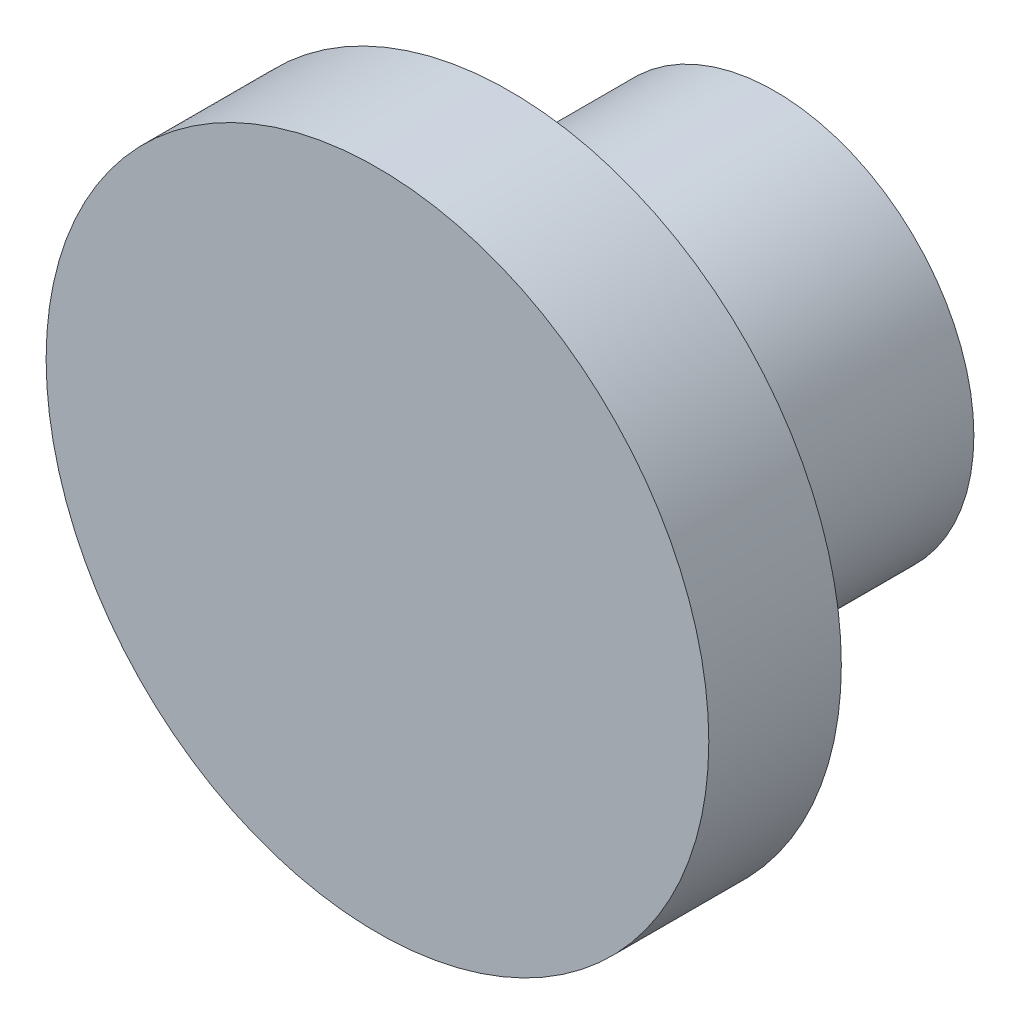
ISO-10303-21;
HEADER;
FILE_DESCRIPTION(('STEP AP214'),'2;1');
FILE_NAME('part.step','',(''),(''),'','','');
FILE_SCHEMA(('AUTOMOTIVE_DESIGN { 1 0 10303 214 1 1 1 1 }'));
ENDSEC;
DATA;
#1=APPLICATION_CONTEXT('core data for automotive mechanical design processes');
#2=APPLICATION_PROTOCOL_DEFINITION('international standard','automotive_design',2000,#1);
#3=PRODUCT_CONTEXT('',#1,'mechanical');
#4=PRODUCT('Part','Part','',(#3));
#5=PRODUCT_RELATED_PRODUCT_CATEGORY('part','',(#4));
#6=PRODUCT_DEFINITION_FORMATION('','',#4);
#7=PRODUCT_DEFINITION_CONTEXT('part definition',#1,'design');
#8=PRODUCT_DEFINITION('design','',#6,#7);
#9=PRODUCT_DEFINITION_SHAPE('','',#8);
#10=(LENGTH_UNIT() NAMED_UNIT(*) SI_UNIT(.MILLI.,.METRE.));
#11=(NAMED_UNIT(*) PLANE_ANGLE_UNIT() SI_UNIT($,.RADIAN.));
#12=(NAMED_UNIT(*) SI_UNIT($,.STERADIAN.) SOLID_ANGLE_UNIT());
#13=UNCERTAINTY_MEASURE_WITH_UNIT(LENGTH_MEASURE(1.E-05),#10,'distance_accuracy_value','');
#14=(GEOMETRIC_REPRESENTATION_CONTEXT(3) GLOBAL_UNCERTAINTY_ASSIGNED_CONTEXT((#13)) GLOBAL_UNIT_ASSIGNED_CONTEXT((#10,
#11,#12)) REPRESENTATION_CONTEXT('',''));
#15=CARTESIAN_POINT('',(0.,0.,0.));
#16=DIRECTION('',(0.,0.,1.));
#17=DIRECTION('',(1.,0.,0.));
#18=AXIS2_PLACEMENT_3D('',#15,#16,#17);
#19=CARTESIAN_POINT('',(34.9999999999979,59.9999999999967,-20.));
#20=DIRECTION('',(0.,0.,1.));
#21=DIRECTION('',(1.,0.,0.));
#22=AXIS2_PLACEMENT_3D('',#19,#20,#21);
#23=CYLINDRICAL_SURFACE('',#22,14.9999999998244);
#24=CARTESIAN_POINT('',(34.9999999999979,59.9999999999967,-20.));
#25=DIRECTION('',(0.,0.,1.));
#26=DIRECTION('',(1.,0.,0.));
#27=AXIS2_PLACEMENT_3D('',#24,#25,#26);
#28=CIRCLE('',#27,14.9999999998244);
#29=CARTESIAN_POINT('',(49.9999999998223,59.9999999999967,-20.));
#30=VERTEX_POINT('',#29);
#31=EDGE_CURVE('E10',#30,#30,#28,.T.);
#32=ORIENTED_EDGE('',*,*,#31,.T.);
#33=EDGE_LOOP('',(#32));
#34=FACE_BOUND('',#33,.T.);
#35=CARTESIAN_POINT('',(34.9999999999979,59.9999999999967,0.));
#36=DIRECTION('',(0.,0.,1.));
#37=DIRECTION('',(1.,0.,0.));
#38=AXIS2_PLACEMENT_3D('',#35,#36,#37);
#39=CIRCLE('',#38,14.9999999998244);
#40=CARTESIAN_POINT('',(49.9999999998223,59.9999999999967,0.));
#41=VERTEX_POINT('',#40);
#42=EDGE_CURVE('E28',#41,#41,#39,.T.);
#43=ORIENTED_EDGE('',*,*,#42,.F.);
#44=EDGE_LOOP('',(#43));
#45=FACE_BOUND('',#44,.T.);
#46=ADVANCED_FACE('F22',(#34,#45),#23,.T.);
#47=CARTESIAN_POINT('',(34.9999999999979,59.9999999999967,-20.));
#48=DIRECTION('',(0.,0.,1.));
#49=DIRECTION('',(1.,0.,0.));
#50=AXIS2_PLACEMENT_3D('',#47,#48,#49);
#51=PLANE('',#50);
#52=CARTESIAN_POINT('',(34.9999999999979,59.9999999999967,-20.));
#53=DIRECTION('',(0.,0.,1.));
#54=DIRECTION('',(1.,0.,0.));
#55=AXIS2_PLACEMENT_3D('',#52,#53,#54);
#56=CIRCLE('',#55,7.99999999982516);
#57=CARTESIAN_POINT('',(42.999999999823,59.9999999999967,-20.));
#58=VERTEX_POINT('',#57);
#59=EDGE_CURVE('E32',#58,#58,#56,.T.);
#60=ORIENTED_EDGE('',*,*,#59,.T.);
#61=EDGE_LOOP('',(#60));
#62=FACE_BOUND('',#61,.T.);
#63=ORIENTED_EDGE('',*,*,#31,.F.);
#64=EDGE_LOOP('',(#63));
#65=FACE_BOUND('',#64,.T.);
#66=ADVANCED_FACE('F64',(#62,#65),#51,.F.);
#67=CARTESIAN_POINT('',(34.9999999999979,59.9999999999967,-20.));
#68=DIRECTION('',(0.,0.,1.));
#69=DIRECTION('',(1.,0.,0.));
#70=AXIS2_PLACEMENT_3D('',#67,#68,#69);
#71=CYLINDRICAL_SURFACE('',#70,7.99999999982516);
#72=ORIENTED_EDGE('',*,*,#59,.F.);
#73=EDGE_LOOP('',(#72));
#74=FACE_BOUND('',#73,.T.);
#75=CARTESIAN_POINT('',(34.9999999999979,59.9999999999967,0.));
#76=DIRECTION('',(0.,0.,1.));
#77=DIRECTION('',(1.,0.,0.));
#78=AXIS2_PLACEMENT_3D('',#75,#76,#77);
#79=CIRCLE('',#78,7.99999999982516);
#80=CARTESIAN_POINT('',(42.999999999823,59.9999999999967,0.));
#81=VERTEX_POINT('',#80);
#82=EDGE_CURVE('E36',#81,#81,#79,.F.);
#83=ORIENTED_EDGE('',*,*,#82,.F.);
#84=EDGE_LOOP('',(#83));
#85=FACE_BOUND('',#84,.T.);
#86=ADVANCED_FACE('F61',(#74,#85),#71,.F.);
#87=CARTESIAN_POINT('',(34.9999999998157,60.0000000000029,0.));
#88=DIRECTION('',(0.,0.,1.));
#89=DIRECTION('',(1.,0.,0.));
#90=AXIS2_PLACEMENT_3D('',#87,#88,#89);
#91=PLANE('',#90);
#92=ORIENTED_EDGE('',*,*,#82,.T.);
#93=EDGE_LOOP('',(#92));
#94=FACE_BOUND('',#93,.T.);
#95=ADVANCED_FACE('F54',(#94),#91,.F.);
#96=CARTESIAN_POINT('',(34.9999999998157,60.0000000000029,10.));
#97=DIRECTION('',(0.,0.,-1.));
#98=DIRECTION('',(-1.,0.,0.));
#99=AXIS2_PLACEMENT_3D('',#96,#97,#98);
#100=CYLINDRICAL_SURFACE('',#99,24.9999999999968);
#101=CARTESIAN_POINT('',(34.9999999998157,60.0000000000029,10.));
#102=DIRECTION('',(0.,0.,1.));
#103=DIRECTION('',(1.,0.,0.));
#104=AXIS2_PLACEMENT_3D('',#101,#102,#103);
#105=CIRCLE('',#104,24.9999999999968);
#106=CARTESIAN_POINT('',(59.9999999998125,60.0000000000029,10.));
#107=VERTEX_POINT('',#106);
#108=EDGE_CURVE('E41',#107,#107,#105,.T.);
#109=ORIENTED_EDGE('',*,*,#108,.F.);
#110=EDGE_LOOP('',(#109));
#111=FACE_BOUND('',#110,.T.);
#112=CARTESIAN_POINT('',(34.9999999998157,60.0000000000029,0.));
#113=DIRECTION('',(0.,0.,1.));
#114=DIRECTION('',(1.,0.,0.));
#115=AXIS2_PLACEMENT_3D('',#112,#113,#114);
#116=CIRCLE('',#115,24.9999999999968);
#117=CARTESIAN_POINT('',(59.9999999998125,60.0000000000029,0.));
#118=VERTEX_POINT('',#117);
#119=EDGE_CURVE('E44',#118,#118,#116,.T.);
#120=ORIENTED_EDGE('',*,*,#119,.T.);
#121=EDGE_LOOP('',(#120));
#122=FACE_BOUND('',#121,.T.);
#123=ADVANCED_FACE('F48',(#111,#122),#100,.T.);
#124=CARTESIAN_POINT('',(34.9999999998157,60.0000000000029,10.));
#125=DIRECTION('',(0.,0.,1.));
#126=DIRECTION('',(1.,0.,0.));
#127=AXIS2_PLACEMENT_3D('',#124,#125,#126);
#128=PLANE('',#127);
#129=ORIENTED_EDGE('',*,*,#108,.T.);
#130=EDGE_LOOP('',(#129));
#131=FACE_BOUND('',#130,.T.);
#132=ADVANCED_FACE('F52',(#131),#128,.T.);
#133=ORIENTED_EDGE('',*,*,#42,.T.);
#134=EDGE_LOOP('',(#133));
#135=FACE_BOUND('',#134,.T.);
#136=ORIENTED_EDGE('',*,*,#119,.F.);
#137=EDGE_LOOP('',(#136));
#138=FACE_BOUND('',#137,.T.);
#139=ADVANCED_FACE('F50',(#135,#138),#91,.F.);
#140=CLOSED_SHELL('',(#46,#66,#86,#95,#123,#132,#139));
#141=MANIFOLD_SOLID_BREP('B2',#140);
#142=ADVANCED_BREP_SHAPE_REPRESENTATION('',(#18,#141),#14);
#143=SHAPE_DEFINITION_REPRESENTATION(#9,#142);
ENDSEC;
END-ISO-10303-21;
